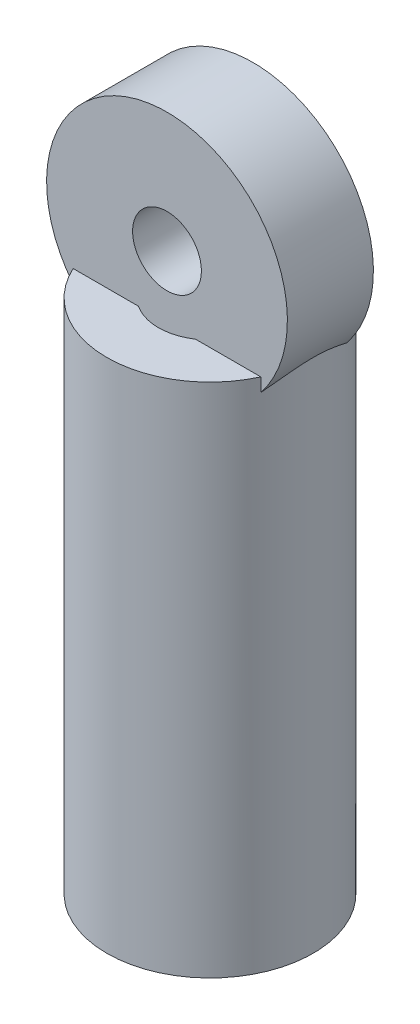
ISO-10303-21;
HEADER;
FILE_DESCRIPTION(('STEP AP214'),'2;1');
FILE_NAME('part.step','',(''),(''),'','','');
FILE_SCHEMA(('AUTOMOTIVE_DESIGN { 1 0 10303 214 1 1 1 1 }'));
ENDSEC;
DATA;
#1=APPLICATION_CONTEXT('core data for automotive mechanical design processes');
#2=APPLICATION_PROTOCOL_DEFINITION('international standard','automotive_design',2000,#1);
#3=PRODUCT_CONTEXT('',#1,'mechanical');
#4=PRODUCT('Part','Part','',(#3));
#5=PRODUCT_RELATED_PRODUCT_CATEGORY('part','',(#4));
#6=PRODUCT_DEFINITION_FORMATION('','',#4);
#7=PRODUCT_DEFINITION_CONTEXT('part definition',#1,'design');
#8=PRODUCT_DEFINITION('design','',#6,#7);
#9=PRODUCT_DEFINITION_SHAPE('','',#8);
#10=(LENGTH_UNIT() NAMED_UNIT(*) SI_UNIT(.MILLI.,.METRE.));
#11=(NAMED_UNIT(*) PLANE_ANGLE_UNIT() SI_UNIT($,.RADIAN.));
#12=(NAMED_UNIT(*) SI_UNIT($,.STERADIAN.) SOLID_ANGLE_UNIT());
#13=UNCERTAINTY_MEASURE_WITH_UNIT(LENGTH_MEASURE(1.E-05),#10,'distance_accuracy_value','');
#14=(GEOMETRIC_REPRESENTATION_CONTEXT(3) GLOBAL_UNCERTAINTY_ASSIGNED_CONTEXT((#13)) GLOBAL_UNIT_ASSIGNED_CONTEXT((#10,
#11,#12)) REPRESENTATION_CONTEXT('',''));
#15=CARTESIAN_POINT('',(0.,0.,0.));
#16=DIRECTION('',(0.,0.,1.));
#17=DIRECTION('',(1.,0.,0.));
#18=AXIS2_PLACEMENT_3D('',#15,#16,#17);
#19=CARTESIAN_POINT('',(0.,0.,2.5));
#20=DIRECTION('',(0.,0.,1.));
#21=DIRECTION('',(1.,0.,0.));
#22=AXIS2_PLACEMENT_3D('',#19,#20,#21);
#23=PLANE('',#22);
#24=CARTESIAN_POINT('',(0.,0.,2.5));
#25=DIRECTION('',(0.,0.,1.));
#26=DIRECTION('',(1.,0.,0.));
#27=AXIS2_PLACEMENT_3D('',#24,#25,#26);
#28=CIRCLE('',#27,2.);
#29=CARTESIAN_POINT('',(2.,0.,2.5));
#30=VERTEX_POINT('',#29);
#31=EDGE_CURVE('E173',#30,#30,#28,.T.);
#32=ORIENTED_EDGE('',*,*,#31,.F.);
#33=EDGE_LOOP('',(#32));
#34=FACE_BOUND('',#33,.T.);
#35=CARTESIAN_POINT('',(0.,0.,2.5));
#36=DIRECTION('',(0.,0.,1.));
#37=DIRECTION('',(1.,0.,0.));
#38=AXIS2_PLACEMENT_3D('',#35,#36,#37);
#39=CIRCLE('',#38,7.);
#40=CARTESIAN_POINT('',(-1.6583123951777,-6.80073525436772,2.5));
#41=VERTEX_POINT('',#40);
#42=CARTESIAN_POINT('',(1.6583123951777,-6.80073525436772,2.5));
#43=VERTEX_POINT('',#42);
#44=EDGE_CURVE('E111',#41,#43,#39,.T.);
#45=ORIENTED_EDGE('',*,*,#44,.T.);
#46=DIRECTION('',(0.,1.,0.));
#47=VECTOR('',#46,1.);
#48=CARTESIAN_POINT('',(1.6583123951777,0.,2.5));
#49=LINE('',#48,#47);
#50=CARTESIAN_POINT('',(1.6583123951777,-3.60555127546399,2.5));
#51=VERTEX_POINT('',#50);
#52=EDGE_CURVE('E54',#43,#51,#49,.T.);
#53=ORIENTED_EDGE('',*,*,#52,.T.);
#54=DIRECTION('',(1.,0.,0.));
#55=VECTOR('',#54,1.);
#56=CARTESIAN_POINT('',(0.,-3.60555127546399,2.5));
#57=LINE('',#56,#55);
#58=CARTESIAN_POINT('',(5.45435605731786,-3.60555127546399,2.5));
#59=VERTEX_POINT('',#58);
#60=EDGE_CURVE('E58',#51,#59,#57,.T.);
#61=ORIENTED_EDGE('',*,*,#60,.T.);
#62=DIRECTION('',(0.,1.,0.));
#63=VECTOR('',#62,1.);
#64=CARTESIAN_POINT('',(5.45435605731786,0.,2.5));
#65=LINE('',#64,#63);
#66=CARTESIAN_POINT('',(5.45435605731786,-4.38748219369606,2.5));
#67=VERTEX_POINT('',#66);
#68=EDGE_CURVE('E114',#59,#67,#65,.F.);
#69=ORIENTED_EDGE('',*,*,#68,.T.);
#70=CARTESIAN_POINT('',(-5.45435605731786,-4.38748219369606,2.5));
#71=VERTEX_POINT('',#70);
#72=EDGE_CURVE('E103',#67,#71,#39,.T.);
#73=ORIENTED_EDGE('',*,*,#72,.T.);
#74=DIRECTION('',(0.,1.,0.));
#75=VECTOR('',#74,1.);
#76=CARTESIAN_POINT('',(-5.45435605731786,0.,2.5));
#77=LINE('',#76,#75);
#78=CARTESIAN_POINT('',(-5.45435605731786,-3.60555127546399,2.5));
#79=VERTEX_POINT('',#78);
#80=EDGE_CURVE('E193',#71,#79,#77,.T.);
#81=ORIENTED_EDGE('',*,*,#80,.T.);
#82=CARTESIAN_POINT('',(-1.6583123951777,-3.60555127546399,2.5));
#83=VERTEX_POINT('',#82);
#84=EDGE_CURVE('E181',#79,#83,#57,.T.);
#85=ORIENTED_EDGE('',*,*,#84,.T.);
#86=DIRECTION('',(0.,1.,0.));
#87=VECTOR('',#86,1.);
#88=CARTESIAN_POINT('',(-1.6583123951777,0.,2.5));
#89=LINE('',#88,#87);
#90=EDGE_CURVE('E160',#83,#41,#89,.F.);
#91=ORIENTED_EDGE('',*,*,#90,.T.);
#92=EDGE_LOOP('',(#45,#53,#61,#69,#73,#81,#85,#91));
#93=FACE_BOUND('',#92,.T.);
#94=ADVANCED_FACE('F34',(#34,#93),#23,.T.);
#95=CARTESIAN_POINT('',(0.,0.,-2.5));
#96=DIRECTION('',(0.,0.,1.));
#97=DIRECTION('',(1.,0.,0.));
#98=AXIS2_PLACEMENT_3D('',#95,#96,#97);
#99=PLANE('',#98);
#100=CARTESIAN_POINT('',(0.,0.,-2.5));
#101=DIRECTION('',(0.,0.,1.));
#102=DIRECTION('',(1.,0.,0.));
#103=AXIS2_PLACEMENT_3D('',#100,#101,#102);
#104=CIRCLE('',#103,2.);
#105=CARTESIAN_POINT('',(2.,0.,-2.5));
#106=VERTEX_POINT('',#105);
#107=EDGE_CURVE('E176',#106,#106,#104,.T.);
#108=ORIENTED_EDGE('',*,*,#107,.T.);
#109=EDGE_LOOP('',(#108));
#110=FACE_BOUND('',#109,.T.);
#111=DIRECTION('',(0.,1.,0.));
#112=VECTOR('',#111,1.);
#113=CARTESIAN_POINT('',(1.6583123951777,0.,-2.5));
#114=LINE('',#113,#112);
#115=CARTESIAN_POINT('',(1.6583123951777,-6.80073525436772,-2.5));
#116=VERTEX_POINT('',#115);
#117=CARTESIAN_POINT('',(1.6583123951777,-3.60555127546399,-2.5));
#118=VERTEX_POINT('',#117);
#119=EDGE_CURVE('E172',#116,#118,#114,.T.);
#120=ORIENTED_EDGE('',*,*,#119,.F.);
#121=CARTESIAN_POINT('',(0.,0.,-2.5));
#122=DIRECTION('',(0.,0.,1.));
#123=DIRECTION('',(1.,0.,0.));
#124=AXIS2_PLACEMENT_3D('',#121,#122,#123);
#125=CIRCLE('',#124,7.);
#126=CARTESIAN_POINT('',(-1.6583123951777,-6.80073525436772,-2.5));
#127=VERTEX_POINT('',#126);
#128=EDGE_CURVE('E112',#127,#116,#125,.T.);
#129=ORIENTED_EDGE('',*,*,#128,.F.);
#130=DIRECTION('',(0.,1.,0.));
#131=VECTOR('',#130,1.);
#132=CARTESIAN_POINT('',(-1.6583123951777,0.,-2.5));
#133=LINE('',#132,#131);
#134=CARTESIAN_POINT('',(-1.6583123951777,-3.60555127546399,-2.5));
#135=VERTEX_POINT('',#134);
#136=EDGE_CURVE('E163',#135,#127,#133,.F.);
#137=ORIENTED_EDGE('',*,*,#136,.F.);
#138=DIRECTION('',(1.,0.,0.));
#139=VECTOR('',#138,1.);
#140=CARTESIAN_POINT('',(0.,-3.60555127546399,-2.5));
#141=LINE('',#140,#139);
#142=CARTESIAN_POINT('',(-5.45435605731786,-3.60555127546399,-2.5));
#143=VERTEX_POINT('',#142);
#144=EDGE_CURVE('E185',#143,#135,#141,.T.);
#145=ORIENTED_EDGE('',*,*,#144,.F.);
#146=DIRECTION('',(0.,1.,0.));
#147=VECTOR('',#146,1.);
#148=CARTESIAN_POINT('',(-5.45435605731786,0.,-2.5));
#149=LINE('',#148,#147);
#150=CARTESIAN_POINT('',(-5.45435605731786,-4.38748219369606,-2.5));
#151=VERTEX_POINT('',#150);
#152=EDGE_CURVE('E118',#151,#143,#149,.T.);
#153=ORIENTED_EDGE('',*,*,#152,.F.);
#154=CARTESIAN_POINT('',(5.45435605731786,-4.38748219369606,-2.5));
#155=VERTEX_POINT('',#154);
#156=EDGE_CURVE('E132',#155,#151,#125,.T.);
#157=ORIENTED_EDGE('',*,*,#156,.F.);
#158=DIRECTION('',(0.,1.,0.));
#159=VECTOR('',#158,1.);
#160=CARTESIAN_POINT('',(5.45435605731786,0.,-2.5));
#161=LINE('',#160,#159);
#162=CARTESIAN_POINT('',(5.45435605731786,-3.60555127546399,-2.5));
#163=VERTEX_POINT('',#162);
#164=EDGE_CURVE('E119',#163,#155,#161,.F.);
#165=ORIENTED_EDGE('',*,*,#164,.F.);
#166=EDGE_CURVE('E186',#118,#163,#141,.T.);
#167=ORIENTED_EDGE('',*,*,#166,.F.);
#168=EDGE_LOOP('',(#120,#129,#137,#145,#153,#157,#165,#167));
#169=FACE_BOUND('',#168,.T.);
#170=ADVANCED_FACE('F169',(#110,#169),#99,.F.);
#171=CARTESIAN_POINT('',(0.,0.,2.5));
#172=DIRECTION('',(0.,0.,-1.));
#173=DIRECTION('',(-1.,0.,0.));
#174=AXIS2_PLACEMENT_3D('',#171,#172,#173);
#175=CYLINDRICAL_SURFACE('',#174,7.);
#176=CARTESIAN_POINT('',(1.6583123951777,-6.80073525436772,2.5));
#177=CARTESIAN_POINT('',(1.72996167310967,-6.78326705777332,2.45246763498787));
#178=CARTESIAN_POINT('',(1.79941554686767,-6.76512797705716,2.40196537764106));
#179=CARTESIAN_POINT('',(1.9336028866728,-6.72800262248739,2.29532888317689));
#180=CARTESIAN_POINT('',(1.99833684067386,-6.70901643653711,2.23919522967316));
#181=CARTESIAN_POINT('',(2.18514430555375,-6.65147450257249,2.06264357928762));
#182=CARTESIAN_POINT('',(2.29963964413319,-6.61238228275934,1.93419723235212));
#183=CARTESIAN_POINT('',(2.50540874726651,-6.53719984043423,1.65906173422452));
#184=CARTESIAN_POINT('',(2.59666972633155,-6.50111127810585,1.51236260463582));
#185=CARTESIAN_POINT('',(2.75310764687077,-6.4364264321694,1.20423125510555));
#186=CARTESIAN_POINT('',(2.81831373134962,-6.4078217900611,1.04281574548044));
#187=CARTESIAN_POINT('',(2.91832222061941,-6.36288723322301,0.715320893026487));
#188=CARTESIAN_POINT('',(2.95409354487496,-6.34616883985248,0.54959311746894));
#189=CARTESIAN_POINT('',(2.99715835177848,-6.32595019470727,0.213689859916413));
#190=CARTESIAN_POINT('',(3.00446538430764,-6.32244365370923,0.0435165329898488));
#191=CARTESIAN_POINT('',(2.99086524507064,-6.32888112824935,-0.280621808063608));
#192=CARTESIAN_POINT('',(2.97234113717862,-6.33768923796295,-0.434716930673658));
#193=CARTESIAN_POINT('',(2.91207769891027,-6.36560226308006,-0.737296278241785));
#194=CARTESIAN_POINT('',(2.87033753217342,-6.38470754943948,-0.885780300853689));
#195=CARTESIAN_POINT('',(2.76476257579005,-6.43112822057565,-1.174716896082));
#196=CARTESIAN_POINT('',(2.70074218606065,-6.45851231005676,-1.31509007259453));
#197=CARTESIAN_POINT('',(2.55259332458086,-6.51848526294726,-1.58361068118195));
#198=CARTESIAN_POINT('',(2.46845111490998,-6.55107767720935,-1.71174967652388));
#199=CARTESIAN_POINT('',(2.27498591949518,-6.62085663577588,-1.96247534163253));
#200=CARTESIAN_POINT('',(2.16425526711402,-6.65820457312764,-2.08393967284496));
#201=CARTESIAN_POINT('',(1.98441675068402,-6.71312383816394,-2.25140313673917));
#202=CARTESIAN_POINT('',(1.92217891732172,-6.73124680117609,-2.30476961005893));
#203=CARTESIAN_POINT('',(1.79340131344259,-6.76669613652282,-2.40633042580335));
#204=CARTESIAN_POINT('',(1.72686134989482,-6.78402247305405,-2.45452453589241));
#205=CARTESIAN_POINT('',(1.6583123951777,-6.80073525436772,-2.5));
#206=B_SPLINE_CURVE_WITH_KNOTS('',3,(#176,#177,#178,#179,#180,#181,#182,#183,#184,#185,#186,
#187,#188,#189,#190,#191,#192,#193,#194,#195,#196,#197,#198,#199,#200,#201,#202,#203,#204,#205),
.UNSPECIFIED.,.F.,.F.,(4,2,2,2,2,2,2,2,2,2,2,2,2,2,4),(0.,0.263040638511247,0.526054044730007,
1.05274946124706,1.57973408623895,2.10612760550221,2.61440922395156,3.12244885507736,
3.58659568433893,4.05075923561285,4.51888579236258,4.98733287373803,5.49063146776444,
5.74228978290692,5.99395939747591),.UNSPECIFIED.);
#207=EDGE_CURVE('E11',#43,#116,#206,.T.);
#208=ORIENTED_EDGE('',*,*,#207,.F.);
#209=ORIENTED_EDGE('',*,*,#44,.F.);
#210=CARTESIAN_POINT('',(-1.6583123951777,-6.80073525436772,-2.5));
#211=CARTESIAN_POINT('',(-1.72996167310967,-6.78326705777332,-2.45246763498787));
#212=CARTESIAN_POINT('',(-1.79941554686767,-6.76512797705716,-2.40196537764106));
#213=CARTESIAN_POINT('',(-1.9336028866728,-6.72800262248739,-2.29532888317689));
#214=CARTESIAN_POINT('',(-1.99833684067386,-6.70901643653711,-2.23919522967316));
#215=CARTESIAN_POINT('',(-2.18514430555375,-6.65147450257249,-2.06264357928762));
#216=CARTESIAN_POINT('',(-2.29963964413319,-6.61238228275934,-1.93419723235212));
#217=CARTESIAN_POINT('',(-2.50540874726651,-6.53719984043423,-1.65906173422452));
#218=CARTESIAN_POINT('',(-2.59666972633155,-6.50111127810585,-1.51236260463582));
#219=CARTESIAN_POINT('',(-2.75310764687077,-6.4364264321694,-1.20423125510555));
#220=CARTESIAN_POINT('',(-2.81831373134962,-6.4078217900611,-1.04281574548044));
#221=CARTESIAN_POINT('',(-2.91832222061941,-6.36288723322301,-0.715320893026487));
#222=CARTESIAN_POINT('',(-2.95409354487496,-6.34616883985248,-0.54959311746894));
#223=CARTESIAN_POINT('',(-2.99715835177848,-6.32595019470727,-0.213689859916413));
#224=CARTESIAN_POINT('',(-3.00446538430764,-6.32244365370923,-0.0435165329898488));
#225=CARTESIAN_POINT('',(-2.99086524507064,-6.32888112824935,0.280621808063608));
#226=CARTESIAN_POINT('',(-2.97234113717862,-6.33768923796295,0.434716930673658));
#227=CARTESIAN_POINT('',(-2.91207769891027,-6.36560226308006,0.737296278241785));
#228=CARTESIAN_POINT('',(-2.87033753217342,-6.38470754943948,0.885780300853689));
#229=CARTESIAN_POINT('',(-2.76476257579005,-6.43112822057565,1.174716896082));
#230=CARTESIAN_POINT('',(-2.70074218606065,-6.45851231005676,1.31509007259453));
#231=CARTESIAN_POINT('',(-2.55259332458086,-6.51848526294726,1.58361068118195));
#232=CARTESIAN_POINT('',(-2.46845111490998,-6.55107767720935,1.71174967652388));
#233=CARTESIAN_POINT('',(-2.27498591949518,-6.62085663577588,1.96247534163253));
#234=CARTESIAN_POINT('',(-2.16425526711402,-6.65820457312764,2.08393967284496));
#235=CARTESIAN_POINT('',(-1.98441675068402,-6.71312383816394,2.25140313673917));
#236=CARTESIAN_POINT('',(-1.92217891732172,-6.73124680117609,2.30476961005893));
#237=CARTESIAN_POINT('',(-1.79340131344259,-6.76669613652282,2.40633042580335));
#238=CARTESIAN_POINT('',(-1.72686134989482,-6.78402247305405,2.45452453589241));
#239=CARTESIAN_POINT('',(-1.6583123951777,-6.80073525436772,2.5));
#240=B_SPLINE_CURVE_WITH_KNOTS('',3,(#210,#211,#212,#213,#214,#215,#216,#217,#218,#219,#220,
#221,#222,#223,#224,#225,#226,#227,#228,#229,#230,#231,#232,#233,#234,#235,#236,#237,#238,#239),
.UNSPECIFIED.,.F.,.F.,(4,2,2,2,2,2,2,2,2,2,2,2,2,2,4),(0.,0.263040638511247,0.526054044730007,
1.05274946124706,1.57973408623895,2.10612760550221,2.61440922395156,3.12244885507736,
3.58659568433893,4.05075923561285,4.51888579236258,4.98733287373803,5.49063146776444,
5.74228978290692,5.99395939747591),.UNSPECIFIED.);
#241=EDGE_CURVE('E47',#127,#41,#240,.T.);
#242=ORIENTED_EDGE('',*,*,#241,.F.);
#243=ORIENTED_EDGE('',*,*,#128,.T.);
#244=EDGE_LOOP('',(#208,#209,#242,#243));
#245=FACE_BOUND('',#244,.T.);
#246=ADVANCED_FACE('F36',(#245),#175,.T.);
#247=CARTESIAN_POINT('',(-5.45435605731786,-4.38748219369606,2.5));
#248=CARTESIAN_POINT('',(-5.49660126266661,-4.33498121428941,2.40780437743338));
#249=CARTESIAN_POINT('',(-5.53676109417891,-4.28348650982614,2.31404006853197));
#250=CARTESIAN_POINT('',(-5.61276955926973,-4.18338812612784,2.12307232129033));
#251=CARTESIAN_POINT('',(-5.64861131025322,-4.13478912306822,2.02586370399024));
#252=CARTESIAN_POINT('',(-5.71632672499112,-4.04067324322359,1.82617295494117));
#253=CARTESIAN_POINT('',(-5.74811516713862,-3.99522959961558,1.7236266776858));
#254=CARTESIAN_POINT('',(-5.80659771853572,-3.90974416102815,1.51498569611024));
#255=CARTESIAN_POINT('',(-5.83329452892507,-3.86969950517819,1.40889290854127));
#256=CARTESIAN_POINT('',(-5.89731757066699,-3.77187263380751,1.12056198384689));
#257=CARTESIAN_POINT('',(-5.92976932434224,-3.72019943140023,0.934963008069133));
#258=CARTESIAN_POINT('',(-5.96524601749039,-3.6628312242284,0.651788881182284));
#259=CARTESIAN_POINT('',(-5.97485884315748,-3.64708896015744,0.556993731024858));
#260=CARTESIAN_POINT('',(-5.98958036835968,-3.62286250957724,0.366150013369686));
#261=CARTESIAN_POINT('',(-5.99469133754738,-3.61437466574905,0.27010210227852));
#262=CARTESIAN_POINT('',(-6.00028912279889,-3.60507432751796,0.0769484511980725));
#263=CARTESIAN_POINT('',(-6.00074937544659,-3.60430592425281,-0.0201601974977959));
#264=CARTESIAN_POINT('',(-5.99696516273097,-3.61059850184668,-0.214031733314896));
#265=CARTESIAN_POINT('',(-5.99272048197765,-3.61765984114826,-0.31079460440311));
#266=CARTESIAN_POINT('',(-5.97958171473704,-3.6393354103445,-0.504055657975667));
#267=CARTESIAN_POINT('',(-5.9706447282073,-3.6540193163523,-0.600542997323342));
#268=CARTESIAN_POINT('',(-5.94831660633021,-3.69025469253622,-0.79170723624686));
#269=CARTESIAN_POINT('',(-5.93492371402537,-3.71180887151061,-0.886383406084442));
#270=CARTESIAN_POINT('',(-5.89649462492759,-3.77269061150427,-1.11851562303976));
#271=CARTESIAN_POINT('',(-5.8689570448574,-3.81557929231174,-1.2546268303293));
#272=CARTESIAN_POINT('',(-5.80553227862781,-3.91140582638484,-1.52139535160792));
#273=CARTESIAN_POINT('',(-5.76963156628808,-3.96435993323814,-1.6520434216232));
#274=CARTESIAN_POINT('',(-5.69093804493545,-4.07649490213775,-1.90539235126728));
#275=CARTESIAN_POINT('',(-5.64828135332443,-4.13554610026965,-2.02819409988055));
#276=CARTESIAN_POINT('',(-5.55625213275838,-4.25840581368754,-2.26813342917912));
#277=CARTESIAN_POINT('',(-5.50690689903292,-4.32219454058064,-2.3852915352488));
#278=CARTESIAN_POINT('',(-5.45435605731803,-4.38748219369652,-2.49999999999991));
#279=B_SPLINE_CURVE_WITH_KNOTS('',3,(#247,#248,#249,#250,#251,#252,#253,#254,#255,#256,#257,
#258,#259,#260,#261,#262,#263,#264,#265,#266,#267,#268,#269,#270,#271,#272,#273,#274,#275,#276,
#277,#278),.UNSPECIFIED.,.F.,.F.,(4,2,2,2,2,2,2,2,2,2,2,2,2,2,2,4),(0.,0.342603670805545,
0.685746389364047,1.03520775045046,1.38448320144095,1.96793969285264,2.25734059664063,
2.54659551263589,2.83750163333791,3.12842107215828,3.42204782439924,3.71579049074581,
4.15093026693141,4.58677876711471,5.01475921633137,5.44104294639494),.UNSPECIFIED.);
#280=EDGE_CURVE('E109',#71,#151,#279,.T.);
#281=ORIENTED_EDGE('',*,*,#280,.F.);
#282=ORIENTED_EDGE('',*,*,#72,.F.);
#283=CARTESIAN_POINT('',(5.45435605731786,-4.38748219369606,-2.5));
#284=CARTESIAN_POINT('',(5.49660126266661,-4.33498121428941,-2.40780437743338));
#285=CARTESIAN_POINT('',(5.53676109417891,-4.28348650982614,-2.31404006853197));
#286=CARTESIAN_POINT('',(5.61276955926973,-4.18338812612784,-2.12307232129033));
#287=CARTESIAN_POINT('',(5.64861131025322,-4.13478912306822,-2.02586370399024));
#288=CARTESIAN_POINT('',(5.71632672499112,-4.04067324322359,-1.82617295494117));
#289=CARTESIAN_POINT('',(5.74811516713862,-3.99522959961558,-1.7236266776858));
#290=CARTESIAN_POINT('',(5.80659771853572,-3.90974416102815,-1.51498569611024));
#291=CARTESIAN_POINT('',(5.83329452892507,-3.86969950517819,-1.40889290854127));
#292=CARTESIAN_POINT('',(5.89731757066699,-3.77187263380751,-1.12056198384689));
#293=CARTESIAN_POINT('',(5.92976932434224,-3.72019943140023,-0.934963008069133));
#294=CARTESIAN_POINT('',(5.96524601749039,-3.6628312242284,-0.651788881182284));
#295=CARTESIAN_POINT('',(5.97485884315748,-3.64708896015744,-0.556993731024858));
#296=CARTESIAN_POINT('',(5.98958036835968,-3.62286250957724,-0.366150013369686));
#297=CARTESIAN_POINT('',(5.99469133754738,-3.61437466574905,-0.27010210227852));
#298=CARTESIAN_POINT('',(6.00028912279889,-3.60507432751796,-0.0769484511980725));
#299=CARTESIAN_POINT('',(6.00074937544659,-3.60430592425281,0.0201601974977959));
#300=CARTESIAN_POINT('',(5.99696516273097,-3.61059850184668,0.214031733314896));
#301=CARTESIAN_POINT('',(5.99272048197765,-3.61765984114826,0.31079460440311));
#302=CARTESIAN_POINT('',(5.97958171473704,-3.6393354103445,0.504055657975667));
#303=CARTESIAN_POINT('',(5.9706447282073,-3.6540193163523,0.600542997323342));
#304=CARTESIAN_POINT('',(5.94831660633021,-3.69025469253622,0.79170723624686));
#305=CARTESIAN_POINT('',(5.93492371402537,-3.71180887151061,0.886383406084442));
#306=CARTESIAN_POINT('',(5.89649462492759,-3.77269061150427,1.11851562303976));
#307=CARTESIAN_POINT('',(5.8689570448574,-3.81557929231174,1.2546268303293));
#308=CARTESIAN_POINT('',(5.80553227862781,-3.91140582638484,1.52139535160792));
#309=CARTESIAN_POINT('',(5.76963156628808,-3.96435993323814,1.6520434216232));
#310=CARTESIAN_POINT('',(5.69093804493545,-4.07649490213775,1.90539235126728));
#311=CARTESIAN_POINT('',(5.64828135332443,-4.13554610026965,2.02819409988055));
#312=CARTESIAN_POINT('',(5.55625213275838,-4.25840581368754,2.26813342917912));
#313=CARTESIAN_POINT('',(5.50690689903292,-4.32219454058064,2.3852915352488));
#314=CARTESIAN_POINT('',(5.45435605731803,-4.38748219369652,2.49999999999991));
#315=B_SPLINE_CURVE_WITH_KNOTS('',3,(#283,#284,#285,#286,#287,#288,#289,#290,#291,#292,#293,
#294,#295,#296,#297,#298,#299,#300,#301,#302,#303,#304,#305,#306,#307,#308,#309,#310,#311,#312,
#313,#314),.UNSPECIFIED.,.F.,.F.,(4,2,2,2,2,2,2,2,2,2,2,2,2,2,2,4),(0.,0.342603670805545,
0.685746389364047,1.03520775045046,1.38448320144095,1.96793969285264,2.25734059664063,
2.54659551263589,2.83750163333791,3.12842107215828,3.42204782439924,3.71579049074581,
4.15093026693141,4.58677876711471,5.01475921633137,5.44104294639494),.UNSPECIFIED.);
#316=EDGE_CURVE('E106',#155,#67,#315,.T.);
#317=ORIENTED_EDGE('',*,*,#316,.F.);
#318=ORIENTED_EDGE('',*,*,#156,.T.);
#319=EDGE_LOOP('',(#281,#282,#317,#318));
#320=FACE_BOUND('',#319,.T.);
#321=ADVANCED_FACE('F104',(#320),#175,.T.);
#322=CARTESIAN_POINT('',(0.,0.,2.5));
#323=DIRECTION('',(0.,0.,-1.));
#324=DIRECTION('',(-1.,0.,0.));
#325=AXIS2_PLACEMENT_3D('',#322,#323,#324);
#326=CYLINDRICAL_SURFACE('',#325,2.);
#327=ORIENTED_EDGE('',*,*,#31,.T.);
#328=EDGE_LOOP('',(#327));
#329=FACE_BOUND('',#328,.T.);
#330=ORIENTED_EDGE('',*,*,#107,.F.);
#331=EDGE_LOOP('',(#330));
#332=FACE_BOUND('',#331,.T.);
#333=ADVANCED_FACE('F218',(#329,#332),#326,.F.);
#334=CARTESIAN_POINT('',(6.,-3.60555127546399,0.));
#335=DIRECTION('',(0.,-1.,0.));
#336=DIRECTION('',(0.,0.,-1.));
#337=AXIS2_PLACEMENT_3D('',#334,#335,#336);
#338=PLANE('',#337);
#339=CARTESIAN_POINT('',(0.,-3.60555127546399,0.));
#340=DIRECTION('',(0.,1.,0.));
#341=DIRECTION('',(0.,0.,1.));
#342=AXIS2_PLACEMENT_3D('',#339,#340,#341);
#343=CIRCLE('',#342,6.);
#344=EDGE_CURVE('E207',#163,#143,#343,.T.);
#345=ORIENTED_EDGE('',*,*,#344,.T.);
#346=ORIENTED_EDGE('',*,*,#144,.T.);
#347=CARTESIAN_POINT('',(0.,-3.60555127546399,0.));
#348=DIRECTION('',(0.,1.,0.));
#349=DIRECTION('',(0.,0.,1.));
#350=AXIS2_PLACEMENT_3D('',#347,#348,#349);
#351=CIRCLE('',#350,3.);
#352=EDGE_CURVE('E198',#118,#135,#351,.T.);
#353=ORIENTED_EDGE('',*,*,#352,.F.);
#354=ORIENTED_EDGE('',*,*,#166,.T.);
#355=EDGE_LOOP('',(#345,#346,#353,#354));
#356=FACE_BOUND('',#355,.T.);
#357=ADVANCED_FACE('F140',(#356),#338,.F.);
#358=CARTESIAN_POINT('',(0.,0.,0.));
#359=DIRECTION('',(0.,1.,0.));
#360=DIRECTION('',(0.,0.,1.));
#361=AXIS2_PLACEMENT_3D('',#358,#359,#360);
#362=CYLINDRICAL_SURFACE('',#361,6.);
#363=ORIENTED_EDGE('',*,*,#80,.F.);
#364=ORIENTED_EDGE('',*,*,#280,.T.);
#365=ORIENTED_EDGE('',*,*,#152,.T.);
#366=ORIENTED_EDGE('',*,*,#344,.F.);
#367=ORIENTED_EDGE('',*,*,#164,.T.);
#368=ORIENTED_EDGE('',*,*,#316,.T.);
#369=ORIENTED_EDGE('',*,*,#68,.F.);
#370=EDGE_CURVE('E208',#79,#59,#343,.T.);
#371=ORIENTED_EDGE('',*,*,#370,.F.);
#372=EDGE_LOOP('',(#363,#364,#365,#366,#367,#368,#369,#371));
#373=FACE_BOUND('',#372,.T.);
#374=CARTESIAN_POINT('',(0.,-33.605551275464,0.));
#375=DIRECTION('',(0.,1.,0.));
#376=DIRECTION('',(0.,0.,1.));
#377=AXIS2_PLACEMENT_3D('',#374,#375,#376);
#378=CIRCLE('',#377,6.);
#379=CARTESIAN_POINT('',(0.,-33.605551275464,6.));
#380=VERTEX_POINT('',#379);
#381=EDGE_CURVE('E204',#380,#380,#378,.T.);
#382=ORIENTED_EDGE('',*,*,#381,.T.);
#383=EDGE_LOOP('',(#382));
#384=FACE_BOUND('',#383,.T.);
#385=ADVANCED_FACE('F122',(#373,#384),#362,.T.);
#386=ORIENTED_EDGE('',*,*,#84,.F.);
#387=ORIENTED_EDGE('',*,*,#370,.T.);
#388=ORIENTED_EDGE('',*,*,#60,.F.);
#389=EDGE_CURVE('E199',#83,#51,#351,.T.);
#390=ORIENTED_EDGE('',*,*,#389,.F.);
#391=EDGE_LOOP('',(#386,#387,#388,#390));
#392=FACE_BOUND('',#391,.T.);
#393=ADVANCED_FACE('F139',(#392),#338,.F.);
#394=CARTESIAN_POINT('',(0.,0.,0.));
#395=DIRECTION('',(0.,1.,0.));
#396=DIRECTION('',(0.,0.,1.));
#397=AXIS2_PLACEMENT_3D('',#394,#395,#396);
#398=CYLINDRICAL_SURFACE('',#397,3.);
#399=ORIENTED_EDGE('',*,*,#52,.F.);
#400=ORIENTED_EDGE('',*,*,#207,.T.);
#401=ORIENTED_EDGE('',*,*,#119,.T.);
#402=ORIENTED_EDGE('',*,*,#352,.T.);
#403=ORIENTED_EDGE('',*,*,#136,.T.);
#404=ORIENTED_EDGE('',*,*,#241,.T.);
#405=ORIENTED_EDGE('',*,*,#90,.F.);
#406=ORIENTED_EDGE('',*,*,#389,.T.);
#407=EDGE_LOOP('',(#399,#400,#401,#402,#403,#404,#405,#406));
#408=FACE_BOUND('',#407,.T.);
#409=CARTESIAN_POINT('',(0.,-33.605551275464,0.));
#410=DIRECTION('',(0.,1.,0.));
#411=DIRECTION('',(0.,0.,1.));
#412=AXIS2_PLACEMENT_3D('',#409,#410,#411);
#413=CIRCLE('',#412,3.);
#414=CARTESIAN_POINT('',(0.,-33.605551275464,3.));
#415=VERTEX_POINT('',#414);
#416=EDGE_CURVE('E201',#415,#415,#413,.T.);
#417=ORIENTED_EDGE('',*,*,#416,.F.);
#418=EDGE_LOOP('',(#417));
#419=FACE_BOUND('',#418,.T.);
#420=ADVANCED_FACE('F144',(#408,#419),#398,.F.);
#421=CARTESIAN_POINT('',(3.,-33.605551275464,0.));
#422=DIRECTION('',(0.,1.,0.));
#423=DIRECTION('',(0.,0.,1.));
#424=AXIS2_PLACEMENT_3D('',#421,#422,#423);
#425=PLANE('',#424);
#426=ORIENTED_EDGE('',*,*,#381,.F.);
#427=EDGE_LOOP('',(#426));
#428=FACE_BOUND('',#427,.T.);
#429=ORIENTED_EDGE('',*,*,#416,.T.);
#430=EDGE_LOOP('',(#429));
#431=FACE_BOUND('',#430,.T.);
#432=ADVANCED_FACE('F141',(#428,#431),#425,.F.);
#433=CLOSED_SHELL('',(#94,#170,#246,#321,#333,#357,#385,#393,#420,#432));
#434=MANIFOLD_SOLID_BREP('B2',#433);
#435=ADVANCED_BREP_SHAPE_REPRESENTATION('',(#18,#434),#14);
#436=SHAPE_DEFINITION_REPRESENTATION(#9,#435);
ENDSEC;
END-ISO-10303-21;
